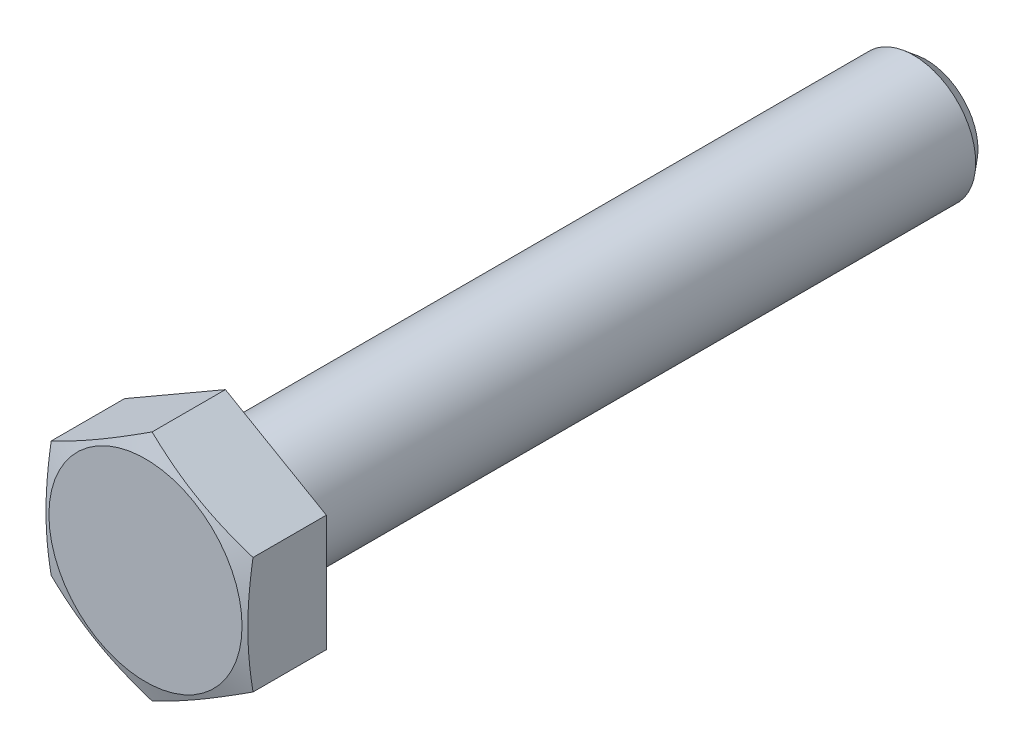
ISO-10303-21;
HEADER;
FILE_DESCRIPTION(('STEP AP214'),'2;1');
FILE_NAME('part.step','',(''),(''),'','','');
FILE_SCHEMA(('AUTOMOTIVE_DESIGN { 1 0 10303 214 1 1 1 1 }'));
ENDSEC;
DATA;
#1=APPLICATION_CONTEXT('core data for automotive mechanical design processes');
#2=APPLICATION_PROTOCOL_DEFINITION('international standard','automotive_design',2000,#1);
#3=PRODUCT_CONTEXT('',#1,'mechanical');
#4=PRODUCT('Part','Part','',(#3));
#5=PRODUCT_RELATED_PRODUCT_CATEGORY('part','',(#4));
#6=PRODUCT_DEFINITION_FORMATION('','',#4);
#7=PRODUCT_DEFINITION_CONTEXT('part definition',#1,'design');
#8=PRODUCT_DEFINITION('design','',#6,#7);
#9=PRODUCT_DEFINITION_SHAPE('','',#8);
#10=(LENGTH_UNIT() NAMED_UNIT(*) SI_UNIT(.MILLI.,.METRE.));
#11=(NAMED_UNIT(*) PLANE_ANGLE_UNIT() SI_UNIT($,.RADIAN.));
#12=(NAMED_UNIT(*) SI_UNIT($,.STERADIAN.) SOLID_ANGLE_UNIT());
#13=UNCERTAINTY_MEASURE_WITH_UNIT(LENGTH_MEASURE(1.E-05),#10,'distance_accuracy_value','');
#14=(GEOMETRIC_REPRESENTATION_CONTEXT(3) GLOBAL_UNCERTAINTY_ASSIGNED_CONTEXT((#13)) GLOBAL_UNIT_ASSIGNED_CONTEXT((#10,
#11,#12)) REPRESENTATION_CONTEXT('',''));
#15=CARTESIAN_POINT('',(0.,0.,0.));
#16=DIRECTION('',(0.,0.,1.));
#17=DIRECTION('',(1.,0.,0.));
#18=AXIS2_PLACEMENT_3D('',#15,#16,#17);
#19=CARTESIAN_POINT('',(0.,0.,0.15));
#20=DIRECTION('',(0.,0.,1.));
#21=DIRECTION('',(1.,0.,0.));
#22=AXIS2_PLACEMENT_3D('',#19,#20,#21);
#23=TOROIDAL_SURFACE('',#22,5.65,0.15);
#24=CARTESIAN_POINT('',(0.,0.,0.15));
#25=DIRECTION('',(0.,0.,1.));
#26=DIRECTION('',(1.,0.,0.));
#27=AXIS2_PLACEMENT_3D('',#24,#25,#26);
#28=CIRCLE('',#27,5.8);
#29=CARTESIAN_POINT('',(5.8,0.,0.15));
#30=VERTEX_POINT('',#29);
#31=EDGE_CURVE('E11',#30,#30,#28,.T.);
#32=ORIENTED_EDGE('',*,*,#31,.F.);
#33=EDGE_LOOP('',(#32));
#34=FACE_BOUND('',#33,.T.);
#35=CARTESIAN_POINT('',(0.,0.,0.));
#36=DIRECTION('',(0.,0.,1.));
#37=DIRECTION('',(1.,0.,0.));
#38=AXIS2_PLACEMENT_3D('',#35,#36,#37);
#39=CIRCLE('',#38,5.65);
#40=CARTESIAN_POINT('',(5.65,0.,0.));
#41=VERTEX_POINT('',#40);
#42=EDGE_CURVE('E39',#41,#41,#39,.T.);
#43=ORIENTED_EDGE('',*,*,#42,.T.);
#44=EDGE_LOOP('',(#43));
#45=FACE_BOUND('',#44,.T.);
#46=ADVANCED_FACE('F32',(#34,#45),#23,.T.);
#47=CARTESIAN_POINT('',(0.,5.65,0.));
#48=DIRECTION('',(0.,0.,-1.));
#49=DIRECTION('',(-1.,0.,0.));
#50=AXIS2_PLACEMENT_3D('',#47,#48,#49);
#51=PLANE('',#50);
#52=CARTESIAN_POINT('',(0.,0.,0.));
#53=DIRECTION('',(0.,0.,1.));
#54=DIRECTION('',(1.,0.,0.));
#55=AXIS2_PLACEMENT_3D('',#52,#53,#54);
#56=CIRCLE('',#55,4.4);
#57=CARTESIAN_POINT('',(4.4,0.,0.));
#58=VERTEX_POINT('',#57);
#59=EDGE_CURVE('E124',#58,#58,#56,.T.);
#60=ORIENTED_EDGE('',*,*,#59,.T.);
#61=EDGE_LOOP('',(#60));
#62=FACE_BOUND('',#61,.T.);
#63=ORIENTED_EDGE('',*,*,#42,.F.);
#64=EDGE_LOOP('',(#63));
#65=FACE_BOUND('',#64,.T.);
#66=ADVANCED_FACE('F130',(#62,#65),#51,.T.);
#67=CARTESIAN_POINT('',(0.,0.,-0.4));
#68=DIRECTION('',(0.,0.,1.));
#69=DIRECTION('',(1.,0.,0.));
#70=AXIS2_PLACEMENT_3D('',#67,#68,#69);
#71=TOROIDAL_SURFACE('',#70,4.4,0.4);
#72=CARTESIAN_POINT('',(0.,0.,-0.4));
#73=DIRECTION('',(0.,0.,1.));
#74=DIRECTION('',(1.,0.,0.));
#75=AXIS2_PLACEMENT_3D('',#72,#73,#74);
#76=CIRCLE('',#75,4.);
#77=CARTESIAN_POINT('',(4.,0.,-0.4));
#78=VERTEX_POINT('',#77);
#79=EDGE_CURVE('E121',#78,#78,#76,.T.);
#80=ORIENTED_EDGE('',*,*,#79,.T.);
#81=EDGE_LOOP('',(#80));
#82=FACE_BOUND('',#81,.T.);
#83=ORIENTED_EDGE('',*,*,#59,.F.);
#84=EDGE_LOOP('',(#83));
#85=FACE_BOUND('',#84,.T.);
#86=ADVANCED_FACE('F132',(#82,#85),#71,.F.);
#87=CARTESIAN_POINT('',(-6.5,-3.752775,0.15));
#88=DIRECTION('',(0.,0.,-1.));
#89=DIRECTION('',(-1.,0.,0.));
#90=AXIS2_PLACEMENT_3D('',#87,#88,#89);
#91=PLANE('',#90);
#92=DIRECTION('',(0.,-1.,0.));
#93=VECTOR('',#92,1.);
#94=CARTESIAN_POINT('',(-6.5,3.752775,0.15));
#95=LINE('',#94,#93);
#96=CARTESIAN_POINT('',(-6.5,3.752775,0.15));
#97=VERTEX_POINT('',#96);
#98=CARTESIAN_POINT('',(-6.5,-3.752775,0.15));
#99=VERTEX_POINT('',#98);
#100=EDGE_CURVE('E98',#97,#99,#95,.T.);
#101=ORIENTED_EDGE('',*,*,#100,.F.);
#102=DIRECTION('',(0.866025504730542,0.499999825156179,0.));
#103=VECTOR('',#102,1.);
#104=CARTESIAN_POINT('',(-6.5,3.752775,0.15));
#105=LINE('',#104,#103);
#106=CARTESIAN_POINT('',(0.,7.50555,0.15));
#107=VERTEX_POINT('',#106);
#108=EDGE_CURVE('E103',#97,#107,#105,.T.);
#109=ORIENTED_EDGE('',*,*,#108,.T.);
#110=DIRECTION('',(0.866025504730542,-0.499999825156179,0.));
#111=VECTOR('',#110,1.);
#112=CARTESIAN_POINT('',(0.,7.50555,0.15));
#113=LINE('',#112,#111);
#114=CARTESIAN_POINT('',(6.5,3.752775,0.15));
#115=VERTEX_POINT('',#114);
#116=EDGE_CURVE('E109',#107,#115,#113,.T.);
#117=ORIENTED_EDGE('',*,*,#116,.T.);
#118=DIRECTION('',(0.,-1.,0.));
#119=VECTOR('',#118,1.);
#120=CARTESIAN_POINT('',(6.5,3.752775,0.15));
#121=LINE('',#120,#119);
#122=CARTESIAN_POINT('',(6.5,-3.752775,0.15));
#123=VERTEX_POINT('',#122);
#124=EDGE_CURVE('E245',#115,#123,#121,.T.);
#125=ORIENTED_EDGE('',*,*,#124,.T.);
#126=DIRECTION('',(-0.866025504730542,-0.499999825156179,0.));
#127=VECTOR('',#126,1.);
#128=CARTESIAN_POINT('',(6.5,-3.752775,0.15));
#129=LINE('',#128,#127);
#130=CARTESIAN_POINT('',(0.,-7.50555,0.15));
#131=VERTEX_POINT('',#130);
#132=EDGE_CURVE('E231',#123,#131,#129,.T.);
#133=ORIENTED_EDGE('',*,*,#132,.T.);
#134=DIRECTION('',(-0.866025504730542,0.499999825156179,0.));
#135=VECTOR('',#134,1.);
#136=CARTESIAN_POINT('',(0.,-7.50555,0.15));
#137=LINE('',#136,#135);
#138=EDGE_CURVE('E229',#131,#99,#137,.T.);
#139=ORIENTED_EDGE('',*,*,#138,.T.);
#140=EDGE_LOOP('',(#101,#109,#117,#125,#133,#139));
#141=FACE_BOUND('',#140,.T.);
#142=ORIENTED_EDGE('',*,*,#31,.T.);
#143=EDGE_LOOP('',(#142));
#144=FACE_BOUND('',#143,.T.);
#145=ADVANCED_FACE('F138',(#141,#144),#91,.T.);
#146=CARTESIAN_POINT('',(-6.5,3.752775,0.15));
#147=DIRECTION('',(-1.,0.,0.));
#148=DIRECTION('',(0.,0.,1.));
#149=AXIS2_PLACEMENT_3D('',#146,#147,#148);
#150=PLANE('',#149);
#151=CARTESIAN_POINT('',(-6.5,-9.92768465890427,3.42219076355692));
#152=CARTESIAN_POINT('',(-6.5,-9.63320200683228,3.50410507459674));
#153=CARTESIAN_POINT('',(-6.5,-9.33844353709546,3.58504584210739));
#154=CARTESIAN_POINT('',(-6.5,-8.74823643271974,3.74444577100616));
#155=CARTESIAN_POINT('',(-6.5,-8.45278775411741,3.82290476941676));
#156=CARTESIAN_POINT('',(-6.5,-7.86064924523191,3.97691306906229));
#157=CARTESIAN_POINT('',(-6.5,-7.56395820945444,4.05245775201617));
#158=CARTESIAN_POINT('',(-6.5,-6.96964246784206,4.19977756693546));
#159=CARTESIAN_POINT('',(-6.5,-6.67201777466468,4.27155274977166));
#160=CARTESIAN_POINT('',(-6.5,-6.07920080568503,4.40958972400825));
#161=CARTESIAN_POINT('',(-6.5,-5.78402145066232,4.47590673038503));
#162=CARTESIAN_POINT('',(-6.5,-5.19244039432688,4.60283348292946));
#163=CARTESIAN_POINT('',(-6.5,-4.89603873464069,4.66344342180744));
#164=CARTESIAN_POINT('',(-6.5,-4.30192301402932,4.77756540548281));
#165=CARTESIAN_POINT('',(-6.5,-4.00420923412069,4.83107890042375));
#166=CARTESIAN_POINT('',(-6.5,-3.4073313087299,4.92939310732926));
#167=CARTESIAN_POINT('',(-6.5,-3.10816717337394,4.9741938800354));
#168=CARTESIAN_POINT('',(-6.5,-2.51584786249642,5.05231938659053));
#169=CARTESIAN_POINT('',(-6.5,-2.22272695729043,5.08590043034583));
#170=CARTESIAN_POINT('',(-6.5,-1.6353790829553,5.14147194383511));
#171=CARTESIAN_POINT('',(-6.5,-1.34115215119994,5.16346280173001));
#172=CARTESIAN_POINT('',(-6.5,-0.752211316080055,5.19459534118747));
#173=CARTESIAN_POINT('',(-6.5,-0.457497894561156,5.20374596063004));
#174=CARTESIAN_POINT('',(-6.5,0.132041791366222,5.20865235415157));
#175=CARTESIAN_POINT('',(-6.5,0.426868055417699,5.20440817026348));
#176=CARTESIAN_POINT('',(-6.5,1.01755930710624,5.18273935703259));
#177=CARTESIAN_POINT('',(-6.5,1.31342173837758,5.16524639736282));
#178=CARTESIAN_POINT('',(-6.5,1.90416213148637,5.11804868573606));
#179=CARTESIAN_POINT('',(-6.5,2.19904006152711,5.08834354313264));
#180=CARTESIAN_POINT('',(-6.5,2.78778899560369,5.01822295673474));
#181=CARTESIAN_POINT('',(-6.5,3.08165875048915,4.97779718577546));
#182=CARTESIAN_POINT('',(-6.5,3.66800309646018,4.88794282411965));
#183=CARTESIAN_POINT('',(-6.5,3.96047768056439,4.83851418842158));
#184=CARTESIAN_POINT('',(-6.5,4.53383951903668,4.734123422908));
#185=CARTESIAN_POINT('',(-6.5,4.81477360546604,4.67941596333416));
#186=CARTESIAN_POINT('',(-6.5,5.37549299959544,4.56437238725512));
#187=CARTESIAN_POINT('',(-6.5,5.65527825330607,4.50403600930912));
#188=CARTESIAN_POINT('',(-6.5,6.21386077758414,4.3787797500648));
#189=CARTESIAN_POINT('',(-6.5,6.49265788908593,4.31385916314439));
#190=CARTESIAN_POINT('',(-6.5,7.0493618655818,4.18029589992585));
#191=CARTESIAN_POINT('',(-6.5,7.3272687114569,4.11165314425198));
#192=CARTESIAN_POINT('',(-6.5,7.88244293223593,3.97129958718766));
#193=CARTESIAN_POINT('',(-6.5,8.159709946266,3.89958736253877));
#194=CARTESIAN_POINT('',(-6.5,8.71358713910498,3.75366585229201));
#195=CARTESIAN_POINT('',(-6.5,8.99019731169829,3.67945654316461));
#196=CARTESIAN_POINT('',(-6.5,9.81912857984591,3.45377511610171));
#197=CARTESIAN_POINT('',(-6.5,10.3706135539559,3.29923331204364));
#198=CARTESIAN_POINT('',(-6.5,11.4645427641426,2.98659237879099));
#199=CARTESIAN_POINT('',(-6.5,12.0070088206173,2.82856906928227));
#200=CARTESIAN_POINT('',(-6.5,13.090775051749,2.5085206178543));
#201=CARTESIAN_POINT('',(-6.5,13.6320751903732,2.34649535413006));
#202=CARTESIAN_POINT('',(-6.5,14.7126438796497,2.01984553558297));
#203=CARTESIAN_POINT('',(-6.5,15.2519143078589,1.85522717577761));
#204=CARTESIAN_POINT('',(-6.5,16.3297306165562,1.52373570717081));
#205=CARTESIAN_POINT('',(-6.5,16.8682765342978,1.3568627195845));
#206=CARTESIAN_POINT('',(-6.5,17.4065709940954,1.18919184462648));
#207=B_SPLINE_CURVE_WITH_KNOTS('',3,(#151,#152,#153,#154,#155,#156,#157,#158,#159,#160,#161,
#162,#163,#164,#165,#166,#167,#168,#169,#170,#171,#172,#173,#174,#175,#176,#177,#178,#179,#180,
#181,#182,#183,#184,#185,#186,#187,#188,#189,#190,#191,#192,#193,#194,#195,#196,#197,#198,#199,
#200,#201,#202,#203,#204,#205,#206),.UNSPECIFIED.,.F.,.F.,(4,2,2,2,2,2,2,2,2,2,2,2,2,2,2,2,2,2,
2,2,2,2,2,2,2,2,2,4),(0.,0.916995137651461,1.83405036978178,2.75250368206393,3.67094459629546,
4.57851158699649,5.48604792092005,6.39339851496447,7.30074278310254,8.18565759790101,
9.07054277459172,9.95481169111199,10.8390778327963,11.7279358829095,12.616822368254,
13.5065682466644,14.3963185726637,15.2548833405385,16.1134880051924,16.9722251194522,
17.830980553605,18.6901385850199,19.5493047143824,21.2674414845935,22.9624656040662,
24.6575413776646,26.3490461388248,28.0404603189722),.UNSPECIFIED.);
#208=CARTESIAN_POINT('',(-6.5,3.752775,4.87245657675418));
#209=VERTEX_POINT('',#208);
#210=CARTESIAN_POINT('',(-6.5,-3.752775,4.87245657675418));
#211=VERTEX_POINT('',#210);
#212=EDGE_CURVE('E87',#209,#211,#207,.F.);
#213=ORIENTED_EDGE('',*,*,#212,.F.);
#214=DIRECTION('',(0.,0.,1.));
#215=VECTOR('',#214,1.);
#216=CARTESIAN_POINT('',(-6.5,3.752775,0.15));
#217=LINE('',#216,#215);
#218=EDGE_CURVE('E96',#97,#209,#217,.T.);
#219=ORIENTED_EDGE('',*,*,#218,.F.);
#220=ORIENTED_EDGE('',*,*,#100,.T.);
#221=DIRECTION('',(0.,0.,1.));
#222=VECTOR('',#221,1.);
#223=CARTESIAN_POINT('',(-6.5,-3.752775,0.15));
#224=LINE('',#223,#222);
#225=EDGE_CURVE('E54',#99,#211,#224,.T.);
#226=ORIENTED_EDGE('',*,*,#225,.T.);
#227=EDGE_LOOP('',(#213,#219,#220,#226));
#228=FACE_BOUND('',#227,.T.);
#229=ADVANCED_FACE('F94',(#228),#150,.T.);
#230=CARTESIAN_POINT('',(0.,-7.50555,0.15));
#231=DIRECTION('',(0.499999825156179,0.866025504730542,0.));
#232=DIRECTION('',(0.866025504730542,-0.499999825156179,0.));
#233=AXIS2_PLACEMENT_3D('',#230,#231,#232);
#234=PLANE('',#233);
#235=DIRECTION('',(0.,0.,1.));
#236=VECTOR('',#235,1.);
#237=CARTESIAN_POINT('',(0.,-7.50555,0.15));
#238=LINE('',#237,#236);
#239=CARTESIAN_POINT('',(0.,-7.50555,4.87245744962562));
#240=VERTEX_POINT('',#239);
#241=EDGE_CURVE('E236',#131,#240,#238,.T.);
#242=ORIENTED_EDGE('',*,*,#241,.T.);
#243=CARTESIAN_POINT('',(2.00000000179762E-07,-7.50555011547,4.87245741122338));
#244=CARTESIAN_POINT('',(-0.269447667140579,-7.34998438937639,4.92421240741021));
#245=CARTESIAN_POINT('',(-0.539641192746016,-7.19398815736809,4.97125826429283));
#246=CARTESIAN_POINT('',(-1.08149605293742,-6.88114825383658,5.05398662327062));
#247=CARTESIAN_POINT('',(-1.35315821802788,-6.7243041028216,5.0896618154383));
#248=CARTESIAN_POINT('',(-1.89542621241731,-6.41122567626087,5.14740289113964));
#249=CARTESIAN_POINT('',(-2.16602338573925,-6.25499639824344,5.16957424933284));
#250=CARTESIAN_POINT('',(-2.7077471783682,-5.94223216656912,5.19930920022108));
#251=CARTESIAN_POINT('',(-2.97887360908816,-5.78569732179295,5.20687728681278));
#252=CARTESIAN_POINT('',(-3.52112646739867,-5.47262763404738,5.2068772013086));
#253=CARTESIAN_POINT('',(-3.79225289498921,-5.31609279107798,5.19930902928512));
#254=CARTESIAN_POINT('',(-4.33397667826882,-5.00332856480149,5.16957391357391));
#255=CARTESIAN_POINT('',(-4.60457384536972,-4.84709929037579,5.14740247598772));
#256=CARTESIAN_POINT('',(-5.14684182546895,-4.5340208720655,5.08966125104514));
#257=CARTESIAN_POINT('',(-5.41850398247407,-4.37717672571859,5.05398598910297));
#258=CARTESIAN_POINT('',(-5.96035882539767,-4.06433683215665,4.97125750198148));
#259=CARTESIAN_POINT('',(-6.23055234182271,-3.90834060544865,4.92421158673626));
#260=CARTESIAN_POINT('',(-6.5000002,-3.75277488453,4.87245653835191));
#261=B_SPLINE_CURVE_WITH_KNOTS('',3,(#243,#244,#245,#246,#247,#248,#249,#250,#251,#252,#253,
#254,#255,#256,#257,#258,#259,#260),.UNSPECIFIED.,.F.,.F.,(4,2,2,2,2,2,2,2,4),(0.,
0.946299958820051,1.89320704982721,2.83261995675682,3.7717437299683,4.71086749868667,
5.65028040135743,6.59718748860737,7.54348744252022),.UNSPECIFIED.);
#262=EDGE_CURVE('E99',#240,#211,#261,.T.);
#263=ORIENTED_EDGE('',*,*,#262,.T.);
#264=ORIENTED_EDGE('',*,*,#225,.F.);
#265=ORIENTED_EDGE('',*,*,#138,.F.);
#266=EDGE_LOOP('',(#242,#263,#264,#265));
#267=FACE_BOUND('',#266,.T.);
#268=ADVANCED_FACE('F159',(#267),#234,.F.);
#269=CARTESIAN_POINT('',(6.5,-3.752775,0.15));
#270=DIRECTION('',(-0.499999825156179,0.866025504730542,0.));
#271=DIRECTION('',(0.866025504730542,0.499999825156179,0.));
#272=AXIS2_PLACEMENT_3D('',#269,#270,#271);
#273=PLANE('',#272);
#274=DIRECTION('',(0.,0.,1.));
#275=VECTOR('',#274,1.);
#276=CARTESIAN_POINT('',(6.5,-3.752775,0.15));
#277=LINE('',#276,#275);
#278=CARTESIAN_POINT('',(6.5,-3.752775,4.87245657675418));
#279=VERTEX_POINT('',#278);
#280=EDGE_CURVE('E239',#123,#279,#277,.T.);
#281=ORIENTED_EDGE('',*,*,#280,.T.);
#282=CARTESIAN_POINT('',(6.5000002,-3.75277488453,4.87245653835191));
#283=CARTESIAN_POINT('',(6.23055234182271,-3.90834060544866,4.92421158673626));
#284=CARTESIAN_POINT('',(5.96035882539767,-4.06433683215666,4.97125750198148));
#285=CARTESIAN_POINT('',(5.41850398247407,-4.37717672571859,5.05398598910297));
#286=CARTESIAN_POINT('',(5.14684182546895,-4.5340208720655,5.08966125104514));
#287=CARTESIAN_POINT('',(4.60457384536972,-4.84709929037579,5.14740247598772));
#288=CARTESIAN_POINT('',(4.33397667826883,-5.00332856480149,5.16957391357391));
#289=CARTESIAN_POINT('',(3.79225289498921,-5.31609279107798,5.19930902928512));
#290=CARTESIAN_POINT('',(3.52112646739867,-5.47262763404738,5.20687720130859));
#291=CARTESIAN_POINT('',(2.97887360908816,-5.78569732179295,5.20687728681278));
#292=CARTESIAN_POINT('',(2.7077471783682,-5.94223216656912,5.19930920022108));
#293=CARTESIAN_POINT('',(2.16602338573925,-6.25499639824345,5.16957424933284));
#294=CARTESIAN_POINT('',(1.89542621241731,-6.41122567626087,5.14740289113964));
#295=CARTESIAN_POINT('',(1.35315821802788,-6.72430410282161,5.0896618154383));
#296=CARTESIAN_POINT('',(1.08149605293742,-6.88114825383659,5.05398662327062));
#297=CARTESIAN_POINT('',(0.539641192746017,-7.19398815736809,4.97125826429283));
#298=CARTESIAN_POINT('',(0.269447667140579,-7.34998438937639,4.92421240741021));
#299=CARTESIAN_POINT('',(-2.00000001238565E-07,-7.50555011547,4.87245741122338));
#300=B_SPLINE_CURVE_WITH_KNOTS('',3,(#282,#283,#284,#285,#286,#287,#288,#289,#290,#291,#292,
#293,#294,#295,#296,#297,#298,#299),.UNSPECIFIED.,.F.,.F.,(4,2,2,2,2,2,2,2,4),(0.,
0.94629995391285,1.89320704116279,2.83261994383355,3.77174371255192,4.7108674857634,
5.65028039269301,6.59718748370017,7.54348744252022),.UNSPECIFIED.);
#301=EDGE_CURVE('E201',#279,#240,#300,.T.);
#302=ORIENTED_EDGE('',*,*,#301,.T.);
#303=ORIENTED_EDGE('',*,*,#241,.F.);
#304=ORIENTED_EDGE('',*,*,#132,.F.);
#305=EDGE_LOOP('',(#281,#302,#303,#304));
#306=FACE_BOUND('',#305,.T.);
#307=ADVANCED_FACE('F207',(#306),#273,.F.);
#308=CARTESIAN_POINT('',(6.5,3.752775,0.15));
#309=DIRECTION('',(-1.,0.,0.));
#310=DIRECTION('',(0.,0.,1.));
#311=AXIS2_PLACEMENT_3D('',#308,#309,#310);
#312=PLANE('',#311);
#313=DIRECTION('',(0.,0.,1.));
#314=VECTOR('',#313,1.);
#315=CARTESIAN_POINT('',(6.5,3.752775,0.15));
#316=LINE('',#315,#314);
#317=CARTESIAN_POINT('',(6.5,3.752775,4.87245657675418));
#318=VERTEX_POINT('',#317);
#319=EDGE_CURVE('E107',#115,#318,#316,.T.);
#320=ORIENTED_EDGE('',*,*,#319,.T.);
#321=CARTESIAN_POINT('',(6.5,-9.92768465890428,3.42219076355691));
#322=CARTESIAN_POINT('',(6.5,-9.63320200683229,3.50410507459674));
#323=CARTESIAN_POINT('',(6.5,-9.33844353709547,3.58504584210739));
#324=CARTESIAN_POINT('',(6.5,-8.74823643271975,3.74444577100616));
#325=CARTESIAN_POINT('',(6.5,-8.45278775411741,3.82290476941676));
#326=CARTESIAN_POINT('',(6.5,-7.86064924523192,3.97691306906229));
#327=CARTESIAN_POINT('',(6.5,-7.56395820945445,4.05245775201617));
#328=CARTESIAN_POINT('',(6.5,-6.96964246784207,4.19977756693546));
#329=CARTESIAN_POINT('',(6.5,-6.67201777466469,4.27155274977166));
#330=CARTESIAN_POINT('',(6.5,-6.07920080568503,4.40958972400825));
#331=CARTESIAN_POINT('',(6.5,-5.78402145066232,4.47590673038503));
#332=CARTESIAN_POINT('',(6.5,-5.19244039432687,4.60283348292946));
#333=CARTESIAN_POINT('',(6.5,-4.89603873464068,4.66344342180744));
#334=CARTESIAN_POINT('',(6.5,-4.30192301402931,4.77756540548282));
#335=CARTESIAN_POINT('',(6.5,-4.00420923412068,4.83107890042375));
#336=CARTESIAN_POINT('',(6.5,-3.4073313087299,4.92939310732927));
#337=CARTESIAN_POINT('',(6.5,-3.10816717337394,4.97419388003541));
#338=CARTESIAN_POINT('',(6.5,-2.51584786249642,5.05231938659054));
#339=CARTESIAN_POINT('',(6.5,-2.22272695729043,5.08590043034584));
#340=CARTESIAN_POINT('',(6.5,-1.6353790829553,5.14147194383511));
#341=CARTESIAN_POINT('',(6.5,-1.34115215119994,5.16346280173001));
#342=CARTESIAN_POINT('',(6.5,-0.752211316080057,5.19459534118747));
#343=CARTESIAN_POINT('',(6.5,-0.457497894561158,5.20374596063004));
#344=CARTESIAN_POINT('',(6.5,0.132041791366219,5.20865235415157));
#345=CARTESIAN_POINT('',(6.5,0.426868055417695,5.20440817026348));
#346=CARTESIAN_POINT('',(6.5,1.01755930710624,5.18273935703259));
#347=CARTESIAN_POINT('',(6.5,1.31342173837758,5.16524639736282));
#348=CARTESIAN_POINT('',(6.5,1.90416213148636,5.11804868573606));
#349=CARTESIAN_POINT('',(6.5,2.19904006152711,5.08834354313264));
#350=CARTESIAN_POINT('',(6.5,2.78778899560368,5.01822295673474));
#351=CARTESIAN_POINT('',(6.5,3.08165875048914,4.97779718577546));
#352=CARTESIAN_POINT('',(6.5,3.66800309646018,4.88794282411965));
#353=CARTESIAN_POINT('',(6.5,3.96047768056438,4.83851418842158));
#354=CARTESIAN_POINT('',(6.5,4.53383951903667,4.734123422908));
#355=CARTESIAN_POINT('',(6.5,4.81477360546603,4.67941596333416));
#356=CARTESIAN_POINT('',(6.5,5.37549299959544,4.56437238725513));
#357=CARTESIAN_POINT('',(6.5,5.65527825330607,4.50403600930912));
#358=CARTESIAN_POINT('',(6.5,6.21386077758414,4.3787797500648));
#359=CARTESIAN_POINT('',(6.5,6.49265788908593,4.31385916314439));
#360=CARTESIAN_POINT('',(6.5,7.0493618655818,4.18029589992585));
#361=CARTESIAN_POINT('',(6.5,7.3272687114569,4.11165314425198));
#362=CARTESIAN_POINT('',(6.5,7.88244293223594,3.97129958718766));
#363=CARTESIAN_POINT('',(6.5,8.15970994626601,3.89958736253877));
#364=CARTESIAN_POINT('',(6.5,8.71358713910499,3.75366585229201));
#365=CARTESIAN_POINT('',(6.5,8.9901973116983,3.67945654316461));
#366=CARTESIAN_POINT('',(6.5,9.81912857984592,3.45377511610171));
#367=CARTESIAN_POINT('',(6.5,10.3706135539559,3.29923331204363));
#368=CARTESIAN_POINT('',(6.5,11.4645427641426,2.98659237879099));
#369=CARTESIAN_POINT('',(6.5,12.0070088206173,2.82856906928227));
#370=CARTESIAN_POINT('',(6.5,13.090775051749,2.5085206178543));
#371=CARTESIAN_POINT('',(6.5,13.6320751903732,2.34649535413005));
#372=CARTESIAN_POINT('',(6.5,14.7126438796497,2.01984553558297));
#373=CARTESIAN_POINT('',(6.5,15.2519143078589,1.85522717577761));
#374=CARTESIAN_POINT('',(6.5,16.3297306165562,1.52373570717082));
#375=CARTESIAN_POINT('',(6.5,16.8682765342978,1.3568627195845));
#376=CARTESIAN_POINT('',(6.5,17.4065709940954,1.18919184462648));
#377=B_SPLINE_CURVE_WITH_KNOTS('',3,(#321,#322,#323,#324,#325,#326,#327,#328,#329,#330,#331,
#332,#333,#334,#335,#336,#337,#338,#339,#340,#341,#342,#343,#344,#345,#346,#347,#348,#349,#350,
#351,#352,#353,#354,#355,#356,#357,#358,#359,#360,#361,#362,#363,#364,#365,#366,#367,#368,#369,
#370,#371,#372,#373,#374,#375,#376),.UNSPECIFIED.,.F.,.F.,(4,2,2,2,2,2,2,2,2,2,2,2,2,2,2,2,2,2,
2,2,2,2,2,2,2,2,2,4),(0.,0.916995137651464,1.83405036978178,2.75250368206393,3.67094459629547,
4.57851158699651,5.48604792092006,6.39339851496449,7.30074278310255,8.18565759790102,
9.07054277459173,9.954811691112,10.8390778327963,11.7279358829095,12.616822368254,
13.5065682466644,14.3963185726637,15.2548833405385,16.1134880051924,16.9722251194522,
17.830980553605,18.6901385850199,19.5493047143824,21.2674414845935,22.9624656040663,
24.6575413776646,26.3490461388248,28.0404603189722),.UNSPECIFIED.);
#378=EDGE_CURVE('E195',#318,#279,#377,.F.);
#379=ORIENTED_EDGE('',*,*,#378,.T.);
#380=ORIENTED_EDGE('',*,*,#280,.F.);
#381=ORIENTED_EDGE('',*,*,#124,.F.);
#382=EDGE_LOOP('',(#320,#379,#380,#381));
#383=FACE_BOUND('',#382,.T.);
#384=ADVANCED_FACE('F210',(#383),#312,.F.);
#385=CARTESIAN_POINT('',(0.,7.50555,0.15));
#386=DIRECTION('',(-0.499999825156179,-0.866025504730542,0.));
#387=DIRECTION('',(-0.866025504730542,0.499999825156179,0.));
#388=AXIS2_PLACEMENT_3D('',#385,#386,#387);
#389=PLANE('',#388);
#390=DIRECTION('',(0.,0.,1.));
#391=VECTOR('',#390,1.);
#392=CARTESIAN_POINT('',(0.,7.50555,0.15));
#393=LINE('',#392,#391);
#394=CARTESIAN_POINT('',(0.,7.50555,4.87245744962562));
#395=VERTEX_POINT('',#394);
#396=EDGE_CURVE('E105',#107,#395,#393,.T.);
#397=ORIENTED_EDGE('',*,*,#396,.T.);
#398=CARTESIAN_POINT('',(-1.99999999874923E-07,7.50555011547,4.87245741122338));
#399=CARTESIAN_POINT('',(0.269447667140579,7.34998438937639,4.92421240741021));
#400=CARTESIAN_POINT('',(0.539641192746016,7.19398815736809,4.97125826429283));
#401=CARTESIAN_POINT('',(1.08149605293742,6.88114825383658,5.05398662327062));
#402=CARTESIAN_POINT('',(1.35315821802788,6.7243041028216,5.0896618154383));
#403=CARTESIAN_POINT('',(1.89542621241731,6.41122567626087,5.14740289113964));
#404=CARTESIAN_POINT('',(2.16602338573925,6.25499639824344,5.16957424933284));
#405=CARTESIAN_POINT('',(2.7077471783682,5.94223216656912,5.19930920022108));
#406=CARTESIAN_POINT('',(2.97887360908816,5.78569732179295,5.20687728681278));
#407=CARTESIAN_POINT('',(3.52112646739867,5.47262763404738,5.2068772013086));
#408=CARTESIAN_POINT('',(3.79225289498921,5.31609279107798,5.19930902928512));
#409=CARTESIAN_POINT('',(4.33397667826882,5.00332856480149,5.16957391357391));
#410=CARTESIAN_POINT('',(4.60457384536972,4.84709929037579,5.14740247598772));
#411=CARTESIAN_POINT('',(5.14684182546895,4.5340208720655,5.08966125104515));
#412=CARTESIAN_POINT('',(5.41850398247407,4.37717672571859,5.05398598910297));
#413=CARTESIAN_POINT('',(5.96035882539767,4.06433683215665,4.97125750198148));
#414=CARTESIAN_POINT('',(6.23055234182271,3.90834060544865,4.92421158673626));
#415=CARTESIAN_POINT('',(6.5000002,3.75277488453,4.87245653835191));
#416=B_SPLINE_CURVE_WITH_KNOTS('',3,(#398,#399,#400,#401,#402,#403,#404,#405,#406,#407,#408,
#409,#410,#411,#412,#413,#414,#415),.UNSPECIFIED.,.F.,.F.,(4,2,2,2,2,2,2,2,4),(0.,
0.946299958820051,1.89320704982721,2.83261995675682,3.7717437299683,4.71086749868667,
5.65028040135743,6.59718748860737,7.54348744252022),.UNSPECIFIED.);
#417=EDGE_CURVE('E46',#395,#318,#416,.T.);
#418=ORIENTED_EDGE('',*,*,#417,.T.);
#419=ORIENTED_EDGE('',*,*,#319,.F.);
#420=ORIENTED_EDGE('',*,*,#116,.F.);
#421=EDGE_LOOP('',(#397,#418,#419,#420));
#422=FACE_BOUND('',#421,.T.);
#423=ADVANCED_FACE('F214',(#422),#389,.F.);
#424=CARTESIAN_POINT('',(-6.5,3.752775,0.15));
#425=DIRECTION('',(0.499999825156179,-0.866025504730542,0.));
#426=DIRECTION('',(-0.866025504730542,-0.499999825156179,0.));
#427=AXIS2_PLACEMENT_3D('',#424,#425,#426);
#428=PLANE('',#427);
#429=ORIENTED_EDGE('',*,*,#218,.T.);
#430=CARTESIAN_POINT('',(-6.5000002,3.75277488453,4.8724565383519));
#431=CARTESIAN_POINT('',(-6.23055234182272,3.90834060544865,4.92421158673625));
#432=CARTESIAN_POINT('',(-5.96035882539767,4.06433683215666,4.97125750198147));
#433=CARTESIAN_POINT('',(-5.41850398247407,4.37717672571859,5.05398598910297));
#434=CARTESIAN_POINT('',(-5.14684182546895,4.5340208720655,5.08966125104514));
#435=CARTESIAN_POINT('',(-4.60457384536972,4.84709929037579,5.14740247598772));
#436=CARTESIAN_POINT('',(-4.33397667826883,5.00332856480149,5.16957391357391));
#437=CARTESIAN_POINT('',(-3.79225289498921,5.31609279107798,5.19930902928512));
#438=CARTESIAN_POINT('',(-3.52112646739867,5.47262763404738,5.20687720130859));
#439=CARTESIAN_POINT('',(-2.97887360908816,5.78569732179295,5.20687728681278));
#440=CARTESIAN_POINT('',(-2.7077471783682,5.94223216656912,5.19930920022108));
#441=CARTESIAN_POINT('',(-2.16602338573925,6.25499639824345,5.16957424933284));
#442=CARTESIAN_POINT('',(-1.89542621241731,6.41122567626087,5.14740289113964));
#443=CARTESIAN_POINT('',(-1.35315821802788,6.72430410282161,5.0896618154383));
#444=CARTESIAN_POINT('',(-1.08149605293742,6.88114825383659,5.05398662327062));
#445=CARTESIAN_POINT('',(-0.539641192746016,7.19398815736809,4.97125826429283));
#446=CARTESIAN_POINT('',(-0.269447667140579,7.34998438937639,4.92421240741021));
#447=CARTESIAN_POINT('',(2.00000001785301E-07,7.50555011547,4.87245741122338));
#448=B_SPLINE_CURVE_WITH_KNOTS('',3,(#430,#431,#432,#433,#434,#435,#436,#437,#438,#439,#440,
#441,#442,#443,#444,#445,#446,#447),.UNSPECIFIED.,.F.,.F.,(4,2,2,2,2,2,2,2,4),(0.,
0.946299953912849,1.89320704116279,2.83261994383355,3.77174371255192,4.7108674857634,
5.65028039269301,6.59718748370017,7.54348744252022),.UNSPECIFIED.);
#449=EDGE_CURVE('E83',#209,#395,#448,.T.);
#450=ORIENTED_EDGE('',*,*,#449,.T.);
#451=ORIENTED_EDGE('',*,*,#396,.F.);
#452=ORIENTED_EDGE('',*,*,#108,.F.);
#453=EDGE_LOOP('',(#429,#450,#451,#452));
#454=FACE_BOUND('',#453,.T.);
#455=ADVANCED_FACE('F101',(#454),#428,.F.);
#456=CARTESIAN_POINT('',(0.,0.,4.82253454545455));
#457=DIRECTION('',(0.,0.,-1.));
#458=DIRECTION('',(-1.,0.,0.));
#459=AXIS2_PLACEMENT_3D('',#456,#457,#458);
#460=CONICAL_SURFACE('',#459,7.655661,1.24972999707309);
#461=ORIENTED_EDGE('',*,*,#212,.T.);
#462=ORIENTED_EDGE('',*,*,#262,.F.);
#463=ORIENTED_EDGE('',*,*,#301,.F.);
#464=ORIENTED_EDGE('',*,*,#378,.F.);
#465=ORIENTED_EDGE('',*,*,#417,.F.);
#466=ORIENTED_EDGE('',*,*,#449,.F.);
#467=EDGE_LOOP('',(#461,#462,#463,#464,#465,#466));
#468=FACE_BOUND('',#467,.T.);
#469=CARTESIAN_POINT('',(0.,0.,5.3));
#470=DIRECTION('',(0.,0.,-1.));
#471=DIRECTION('',(-1.,0.,0.));
#472=AXIS2_PLACEMENT_3D('',#469,#470,#471);
#473=CIRCLE('',#472,6.21999097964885);
#474=CARTESIAN_POINT('',(-6.21999097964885,0.,5.3));
#475=VERTEX_POINT('',#474);
#476=EDGE_CURVE('E91',#475,#475,#473,.F.);
#477=ORIENTED_EDGE('',*,*,#476,.F.);
#478=EDGE_LOOP('',(#477));
#479=FACE_BOUND('',#478,.T.);
#480=ADVANCED_FACE('F85',(#468,#479),#460,.T.);
#481=CARTESIAN_POINT('',(-6.5,-3.752775,5.3));
#482=DIRECTION('',(0.,0.,-1.));
#483=DIRECTION('',(-1.,0.,0.));
#484=AXIS2_PLACEMENT_3D('',#481,#482,#483);
#485=PLANE('',#484);
#486=ORIENTED_EDGE('',*,*,#476,.T.);
#487=EDGE_LOOP('',(#486));
#488=FACE_BOUND('',#487,.T.);
#489=ADVANCED_FACE('F154',(#488),#485,.F.);
#490=CARTESIAN_POINT('',(0.,3.3234375,-45.));
#491=DIRECTION('',(0.,0.,-1.));
#492=DIRECTION('',(-1.,0.,0.));
#493=AXIS2_PLACEMENT_3D('',#490,#491,#492);
#494=PLANE('',#493);
#495=CARTESIAN_POINT('',(0.,0.,-45.));
#496=DIRECTION('',(0.,0.,1.));
#497=DIRECTION('',(1.,0.,0.));
#498=AXIS2_PLACEMENT_3D('',#495,#496,#497);
#499=CIRCLE('',#498,3.3234375);
#500=CARTESIAN_POINT('',(3.3234375,0.,-45.));
#501=VERTEX_POINT('',#500);
#502=EDGE_CURVE('E115',#501,#501,#499,.T.);
#503=ORIENTED_EDGE('',*,*,#502,.F.);
#504=EDGE_LOOP('',(#503));
#505=FACE_BOUND('',#504,.T.);
#506=ADVANCED_FACE('F150',(#505),#494,.T.);
#507=CARTESIAN_POINT('',(0.,0.,-44.1734375));
#508=DIRECTION('',(0.,0.,1.));
#509=DIRECTION('',(1.,0.,0.));
#510=AXIS2_PLACEMENT_3D('',#507,#508,#509);
#511=CONICAL_SURFACE('',#510,4.,0.68593535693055);
#512=ORIENTED_EDGE('',*,*,#502,.T.);
#513=EDGE_LOOP('',(#512));
#514=FACE_BOUND('',#513,.T.);
#515=CARTESIAN_POINT('',(0.,0.,-44.1734375));
#516=DIRECTION('',(0.,0.,1.));
#517=DIRECTION('',(1.,0.,0.));
#518=AXIS2_PLACEMENT_3D('',#515,#516,#517);
#519=CIRCLE('',#518,4.);
#520=CARTESIAN_POINT('',(4.,0.,-44.1734375));
#521=VERTEX_POINT('',#520);
#522=EDGE_CURVE('E118',#521,#521,#519,.T.);
#523=ORIENTED_EDGE('',*,*,#522,.F.);
#524=EDGE_LOOP('',(#523));
#525=FACE_BOUND('',#524,.T.);
#526=ADVANCED_FACE('F146',(#514,#525),#511,.T.);
#527=CARTESIAN_POINT('',(0.,0.,0.15));
#528=DIRECTION('',(0.,0.,1.));
#529=DIRECTION('',(1.,0.,0.));
#530=AXIS2_PLACEMENT_3D('',#527,#528,#529);
#531=CYLINDRICAL_SURFACE('',#530,4.);
#532=ORIENTED_EDGE('',*,*,#522,.T.);
#533=EDGE_LOOP('',(#532));
#534=FACE_BOUND('',#533,.T.);
#535=ORIENTED_EDGE('',*,*,#79,.F.);
#536=EDGE_LOOP('',(#535));
#537=FACE_BOUND('',#536,.T.);
#538=ADVANCED_FACE('F143',(#534,#537),#531,.T.);
#539=CLOSED_SHELL('',(#46,#66,#86,#145,#229,#268,#307,#384,#423,#455,#480,#489,#506,#526,#538));
#540=MANIFOLD_SOLID_BREP('B2',#539);
#541=ADVANCED_BREP_SHAPE_REPRESENTATION('',(#18,#540),#14);
#542=SHAPE_DEFINITION_REPRESENTATION(#9,#541);
ENDSEC;
END-ISO-10303-21;
